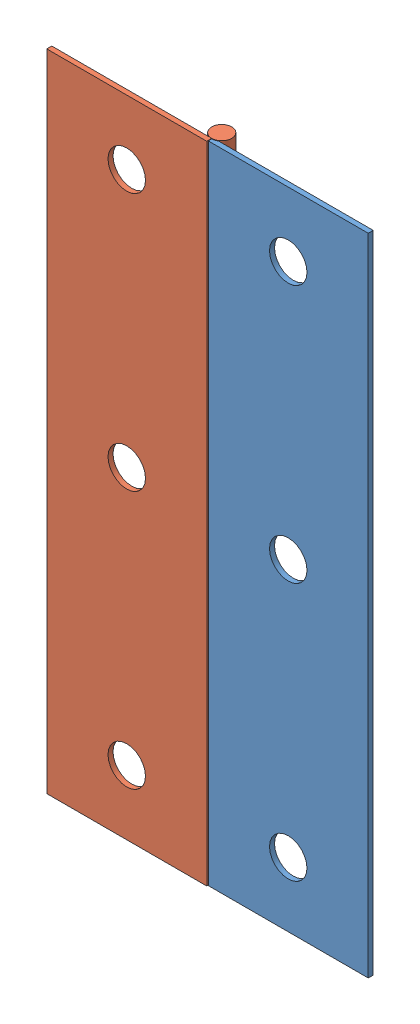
SolidWorks assembly Assem1.sldasm, configuration Default (file format 10000). Lengths in mm.
Overall size (32 64.54 2.5).
2 component instances, 2 part files, 3 mates.
Components (placement in the parent):
- Peice 2-1: Peice 2.SLDPRT [Default] at (-28.0373 -21.5293 3.2642) size (16.85 64.5 2.2)
- Peice 1-1: Peice 1.SLDPRT [Default] at (-28.0373 -21.4872 3.2642) size (17 64.5 2.5)
Mates (geometry in assembly coordinates):
- Concentric1: concentric anti-aligned: circle of Peice 2-1; circle of Peice 1-1
- Coincident1: coincident anti-aligned: plane of Peice 2-1 through (-29.56 4.3128 4.1152) normal (0 1 0); plane of Peice 1-1 through (-31.0419 4.3128 4.2652) normal (0 -1 0)
- LimitAngle1: limit planar angle aligned: plane of Peice 2-1 through (-28.0373 42.9707 4.1142) normal (0 0 -1); plane of Peice 1-1 through (-28.0373 59.0206 4.2642) normal (0 0 -1)
